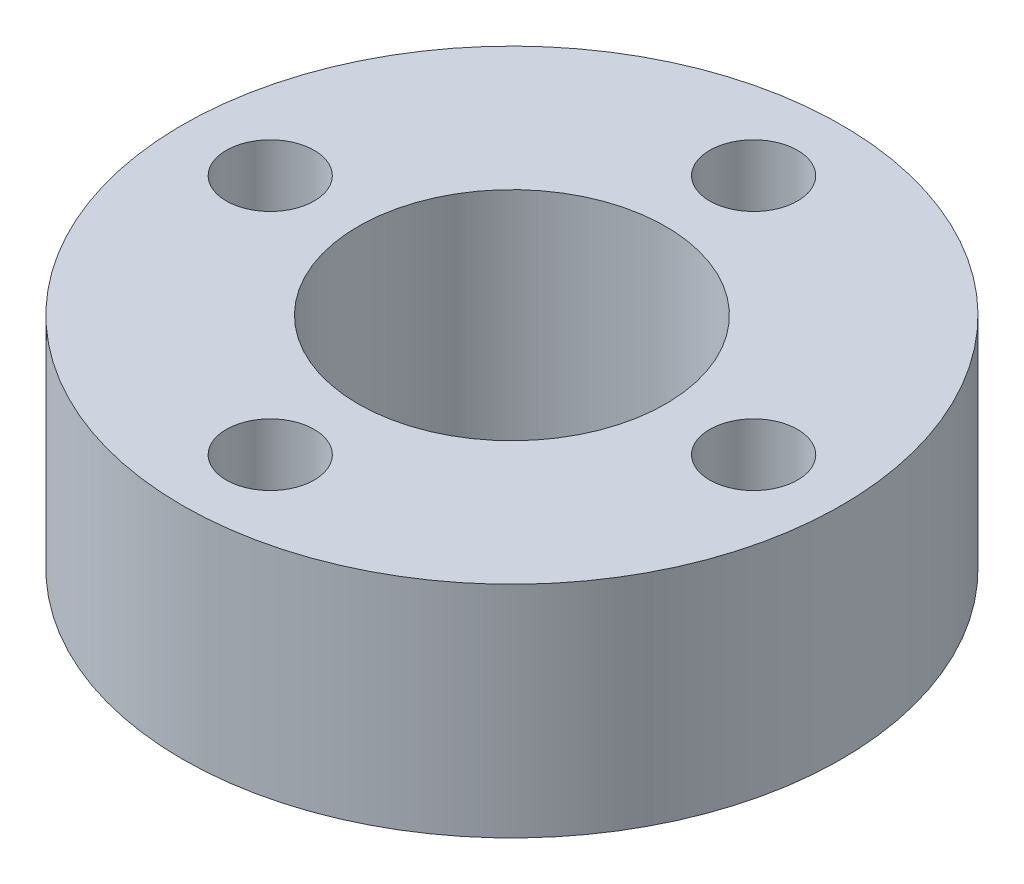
ISO-10303-21;
HEADER;
FILE_DESCRIPTION(('STEP AP214'),'2;1');
FILE_NAME('part.step','',(''),(''),'','','');
FILE_SCHEMA(('AUTOMOTIVE_DESIGN { 1 0 10303 214 1 1 1 1 }'));
ENDSEC;
DATA;
#1=APPLICATION_CONTEXT('core data for automotive mechanical design processes');
#2=APPLICATION_PROTOCOL_DEFINITION('international standard','automotive_design',2000,#1);
#3=PRODUCT_CONTEXT('',#1,'mechanical');
#4=PRODUCT('Part','Part','',(#3));
#5=PRODUCT_RELATED_PRODUCT_CATEGORY('part','',(#4));
#6=PRODUCT_DEFINITION_FORMATION('','',#4);
#7=PRODUCT_DEFINITION_CONTEXT('part definition',#1,'design');
#8=PRODUCT_DEFINITION('design','',#6,#7);
#9=PRODUCT_DEFINITION_SHAPE('','',#8);
#10=(LENGTH_UNIT() NAMED_UNIT(*) SI_UNIT(.MILLI.,.METRE.));
#11=(NAMED_UNIT(*) PLANE_ANGLE_UNIT() SI_UNIT($,.RADIAN.));
#12=(NAMED_UNIT(*) SI_UNIT($,.STERADIAN.) SOLID_ANGLE_UNIT());
#13=UNCERTAINTY_MEASURE_WITH_UNIT(LENGTH_MEASURE(1.E-05),#10,'distance_accuracy_value','');
#14=(GEOMETRIC_REPRESENTATION_CONTEXT(3) GLOBAL_UNCERTAINTY_ASSIGNED_CONTEXT((#13)) GLOBAL_UNIT_ASSIGNED_CONTEXT((#10,
#11,#12)) REPRESENTATION_CONTEXT('',''));
#15=CARTESIAN_POINT('',(0.,0.,0.));
#16=DIRECTION('',(0.,0.,1.));
#17=DIRECTION('',(1.,0.,0.));
#18=AXIS2_PLACEMENT_3D('',#15,#16,#17);
#19=CARTESIAN_POINT('',(0.,10.,0.));
#20=DIRECTION('',(0.,1.,0.));
#21=DIRECTION('',(0.,0.,1.));
#22=AXIS2_PLACEMENT_3D('',#19,#20,#21);
#23=PLANE('',#22);
#24=CARTESIAN_POINT('',(0.,10.,-11.));
#25=DIRECTION('',(0.,1.,0.));
#26=DIRECTION('',(0.,0.,1.));
#27=AXIS2_PLACEMENT_3D('',#24,#25,#26);
#28=CIRCLE('',#27,2.);
#29=CARTESIAN_POINT('',(0.,10.,-9.));
#30=VERTEX_POINT('',#29);
#31=EDGE_CURVE('E56',#30,#30,#28,.T.);
#32=ORIENTED_EDGE('',*,*,#31,.F.);
#33=EDGE_LOOP('',(#32));
#34=FACE_BOUND('',#33,.T.);
#35=CARTESIAN_POINT('',(-11.,10.,0.));
#36=DIRECTION('',(0.,1.,0.));
#37=DIRECTION('',(0.,0.,1.));
#38=AXIS2_PLACEMENT_3D('',#35,#36,#37);
#39=CIRCLE('',#38,2.);
#40=CARTESIAN_POINT('',(-11.,10.,2.));
#41=VERTEX_POINT('',#40);
#42=EDGE_CURVE('E44',#41,#41,#39,.T.);
#43=ORIENTED_EDGE('',*,*,#42,.F.);
#44=EDGE_LOOP('',(#43));
#45=FACE_BOUND('',#44,.T.);
#46=CARTESIAN_POINT('',(0.,10.,0.));
#47=DIRECTION('',(0.,1.,0.));
#48=DIRECTION('',(0.,0.,1.));
#49=AXIS2_PLACEMENT_3D('',#46,#47,#48);
#50=CIRCLE('',#49,15.);
#51=CARTESIAN_POINT('',(0.,10.,15.));
#52=VERTEX_POINT('',#51);
#53=EDGE_CURVE('E10',#52,#52,#50,.T.);
#54=ORIENTED_EDGE('',*,*,#53,.T.);
#55=EDGE_LOOP('',(#54));
#56=FACE_BOUND('',#55,.T.);
#57=CARTESIAN_POINT('',(0.,10.,0.));
#58=DIRECTION('',(0.,1.,0.));
#59=DIRECTION('',(0.,0.,1.));
#60=AXIS2_PLACEMENT_3D('',#57,#58,#59);
#61=CIRCLE('',#60,7.);
#62=CARTESIAN_POINT('',(0.,10.,7.));
#63=VERTEX_POINT('',#62);
#64=EDGE_CURVE('E39',#63,#63,#61,.T.);
#65=ORIENTED_EDGE('',*,*,#64,.F.);
#66=EDGE_LOOP('',(#65));
#67=FACE_BOUND('',#66,.T.);
#68=CARTESIAN_POINT('',(0.,10.,11.));
#69=DIRECTION('',(0.,1.,0.));
#70=DIRECTION('',(0.,0.,1.));
#71=AXIS2_PLACEMENT_3D('',#68,#69,#70);
#72=CIRCLE('',#71,2.);
#73=CARTESIAN_POINT('',(0.,10.,13.));
#74=VERTEX_POINT('',#73);
#75=EDGE_CURVE('E50',#74,#74,#72,.T.);
#76=ORIENTED_EDGE('',*,*,#75,.F.);
#77=EDGE_LOOP('',(#76));
#78=FACE_BOUND('',#77,.T.);
#79=CARTESIAN_POINT('',(11.,10.,0.));
#80=DIRECTION('',(0.,1.,0.));
#81=DIRECTION('',(0.,0.,1.));
#82=AXIS2_PLACEMENT_3D('',#79,#80,#81);
#83=CIRCLE('',#82,2.);
#84=CARTESIAN_POINT('',(11.,10.,2.));
#85=VERTEX_POINT('',#84);
#86=EDGE_CURVE('E62',#85,#85,#83,.T.);
#87=ORIENTED_EDGE('',*,*,#86,.F.);
#88=EDGE_LOOP('',(#87));
#89=FACE_BOUND('',#88,.T.);
#90=ADVANCED_FACE('F28',(#34,#45,#56,#67,#78,#89),#23,.T.);
#91=CARTESIAN_POINT('',(0.,0.,0.));
#92=DIRECTION('',(0.,1.,0.));
#93=DIRECTION('',(0.,0.,1.));
#94=AXIS2_PLACEMENT_3D('',#91,#92,#93);
#95=PLANE('',#94);
#96=CARTESIAN_POINT('',(0.,0.,-11.));
#97=DIRECTION('',(0.,1.,0.));
#98=DIRECTION('',(0.,0.,1.));
#99=AXIS2_PLACEMENT_3D('',#96,#97,#98);
#100=CIRCLE('',#99,2.);
#101=CARTESIAN_POINT('',(0.,0.,-9.));
#102=VERTEX_POINT('',#101);
#103=EDGE_CURVE('E59',#102,#102,#100,.T.);
#104=ORIENTED_EDGE('',*,*,#103,.T.);
#105=EDGE_LOOP('',(#104));
#106=FACE_BOUND('',#105,.T.);
#107=CARTESIAN_POINT('',(-11.,0.,0.));
#108=DIRECTION('',(0.,1.,0.));
#109=DIRECTION('',(0.,0.,1.));
#110=AXIS2_PLACEMENT_3D('',#107,#108,#109);
#111=CIRCLE('',#110,2.);
#112=CARTESIAN_POINT('',(-11.,0.,2.));
#113=VERTEX_POINT('',#112);
#114=EDGE_CURVE('E47',#113,#113,#111,.T.);
#115=ORIENTED_EDGE('',*,*,#114,.T.);
#116=EDGE_LOOP('',(#115));
#117=FACE_BOUND('',#116,.T.);
#118=CARTESIAN_POINT('',(0.,0.,0.));
#119=DIRECTION('',(0.,1.,0.));
#120=DIRECTION('',(0.,0.,1.));
#121=AXIS2_PLACEMENT_3D('',#118,#119,#120);
#122=CIRCLE('',#121,15.);
#123=CARTESIAN_POINT('',(0.,0.,15.));
#124=VERTEX_POINT('',#123);
#125=EDGE_CURVE('E32',#124,#124,#122,.T.);
#126=ORIENTED_EDGE('',*,*,#125,.F.);
#127=EDGE_LOOP('',(#126));
#128=FACE_BOUND('',#127,.T.);
#129=CARTESIAN_POINT('',(0.,0.,0.));
#130=DIRECTION('',(0.,1.,0.));
#131=DIRECTION('',(0.,0.,1.));
#132=AXIS2_PLACEMENT_3D('',#129,#130,#131);
#133=CIRCLE('',#132,7.);
#134=CARTESIAN_POINT('',(0.,0.,7.));
#135=VERTEX_POINT('',#134);
#136=EDGE_CURVE('E41',#135,#135,#133,.T.);
#137=ORIENTED_EDGE('',*,*,#136,.T.);
#138=EDGE_LOOP('',(#137));
#139=FACE_BOUND('',#138,.T.);
#140=CARTESIAN_POINT('',(0.,0.,11.));
#141=DIRECTION('',(0.,1.,0.));
#142=DIRECTION('',(0.,0.,1.));
#143=AXIS2_PLACEMENT_3D('',#140,#141,#142);
#144=CIRCLE('',#143,2.);
#145=CARTESIAN_POINT('',(0.,0.,13.));
#146=VERTEX_POINT('',#145);
#147=EDGE_CURVE('E53',#146,#146,#144,.T.);
#148=ORIENTED_EDGE('',*,*,#147,.T.);
#149=EDGE_LOOP('',(#148));
#150=FACE_BOUND('',#149,.T.);
#151=CARTESIAN_POINT('',(11.,0.,0.));
#152=DIRECTION('',(0.,1.,0.));
#153=DIRECTION('',(0.,0.,1.));
#154=AXIS2_PLACEMENT_3D('',#151,#152,#153);
#155=CIRCLE('',#154,2.);
#156=CARTESIAN_POINT('',(11.,0.,2.));
#157=VERTEX_POINT('',#156);
#158=EDGE_CURVE('E65',#157,#157,#155,.T.);
#159=ORIENTED_EDGE('',*,*,#158,.T.);
#160=EDGE_LOOP('',(#159));
#161=FACE_BOUND('',#160,.T.);
#162=ADVANCED_FACE('F75',(#106,#117,#128,#139,#150,#161),#95,.F.);
#163=CARTESIAN_POINT('',(0.,10.,0.));
#164=DIRECTION('',(0.,-1.,0.));
#165=DIRECTION('',(0.,0.,-1.));
#166=AXIS2_PLACEMENT_3D('',#163,#164,#165);
#167=CYLINDRICAL_SURFACE('',#166,15.);
#168=ORIENTED_EDGE('',*,*,#53,.F.);
#169=EDGE_LOOP('',(#168));
#170=FACE_BOUND('',#169,.T.);
#171=ORIENTED_EDGE('',*,*,#125,.T.);
#172=EDGE_LOOP('',(#171));
#173=FACE_BOUND('',#172,.T.);
#174=ADVANCED_FACE('F30',(#170,#173),#167,.T.);
#175=CARTESIAN_POINT('',(0.,10.,0.));
#176=DIRECTION('',(0.,-1.,0.));
#177=DIRECTION('',(0.,0.,-1.));
#178=AXIS2_PLACEMENT_3D('',#175,#176,#177);
#179=CYLINDRICAL_SURFACE('',#178,7.);
#180=ORIENTED_EDGE('',*,*,#64,.T.);
#181=EDGE_LOOP('',(#180));
#182=FACE_BOUND('',#181,.T.);
#183=ORIENTED_EDGE('',*,*,#136,.F.);
#184=EDGE_LOOP('',(#183));
#185=FACE_BOUND('',#184,.T.);
#186=ADVANCED_FACE('F85',(#182,#185),#179,.F.);
#187=CARTESIAN_POINT('',(-11.,10.,0.));
#188=DIRECTION('',(0.,-1.,0.));
#189=DIRECTION('',(0.,0.,-1.));
#190=AXIS2_PLACEMENT_3D('',#187,#188,#189);
#191=CYLINDRICAL_SURFACE('',#190,2.);
#192=ORIENTED_EDGE('',*,*,#42,.T.);
#193=EDGE_LOOP('',(#192));
#194=FACE_BOUND('',#193,.T.);
#195=ORIENTED_EDGE('',*,*,#114,.F.);
#196=EDGE_LOOP('',(#195));
#197=FACE_BOUND('',#196,.T.);
#198=ADVANCED_FACE('F88',(#194,#197),#191,.F.);
#199=CARTESIAN_POINT('',(0.,10.,11.));
#200=DIRECTION('',(0.,-1.,0.));
#201=DIRECTION('',(0.,0.,-1.));
#202=AXIS2_PLACEMENT_3D('',#199,#200,#201);
#203=CYLINDRICAL_SURFACE('',#202,2.);
#204=ORIENTED_EDGE('',*,*,#75,.T.);
#205=EDGE_LOOP('',(#204));
#206=FACE_BOUND('',#205,.T.);
#207=ORIENTED_EDGE('',*,*,#147,.F.);
#208=EDGE_LOOP('',(#207));
#209=FACE_BOUND('',#208,.T.);
#210=ADVANCED_FACE('F92',(#206,#209),#203,.F.);
#211=CARTESIAN_POINT('',(0.,10.,-11.));
#212=DIRECTION('',(0.,-1.,0.));
#213=DIRECTION('',(0.,0.,-1.));
#214=AXIS2_PLACEMENT_3D('',#211,#212,#213);
#215=CYLINDRICAL_SURFACE('',#214,2.);
#216=ORIENTED_EDGE('',*,*,#31,.T.);
#217=EDGE_LOOP('',(#216));
#218=FACE_BOUND('',#217,.T.);
#219=ORIENTED_EDGE('',*,*,#103,.F.);
#220=EDGE_LOOP('',(#219));
#221=FACE_BOUND('',#220,.T.);
#222=ADVANCED_FACE('F96',(#218,#221),#215,.F.);
#223=CARTESIAN_POINT('',(11.,10.,0.));
#224=DIRECTION('',(0.,-1.,0.));
#225=DIRECTION('',(0.,0.,-1.));
#226=AXIS2_PLACEMENT_3D('',#223,#224,#225);
#227=CYLINDRICAL_SURFACE('',#226,2.);
#228=ORIENTED_EDGE('',*,*,#86,.T.);
#229=EDGE_LOOP('',(#228));
#230=FACE_BOUND('',#229,.T.);
#231=ORIENTED_EDGE('',*,*,#158,.F.);
#232=EDGE_LOOP('',(#231));
#233=FACE_BOUND('',#232,.T.);
#234=ADVANCED_FACE('F71',(#230,#233),#227,.F.);
#235=CLOSED_SHELL('',(#90,#162,#174,#186,#198,#210,#222,#234));
#236=MANIFOLD_SOLID_BREP('B2',#235);
#237=ADVANCED_BREP_SHAPE_REPRESENTATION('',(#18,#236),#14);
#238=SHAPE_DEFINITION_REPRESENTATION(#9,#237);
ENDSEC;
END-ISO-10303-21;
